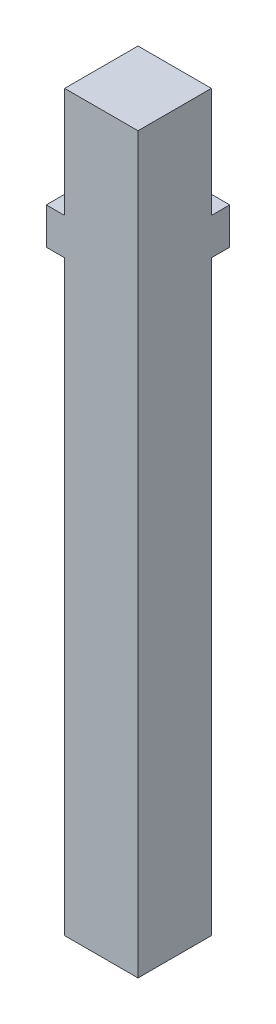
from build123d import *

# Parameters (mm, degrees)
SKETCH1_W           = 25.4
SKETCH1_H           = 25.4
BOSS_EXTRUDE1_DEPTH = 254
BOSS_EXTRUDE2_START = -50.8
SKETCH2_W           = 31.75
SKETCH2_H           = 31.75
BOSS_EXTRUDE2_DEPTH = 12.7


with BuildPart() as part:
    # Sketch1 → Boss-Extrude1 (new body)
    with BuildSketch(Plane(origin=(0, 0, 0), x_dir=(1, 0, 0), z_dir=(0, 1, 0))):
        with Locations((12.7, 12.7)):
            Rectangle(SKETCH1_W, SKETCH1_H)
    extrude(amount=BOSS_EXTRUDE1_DEPTH)

    # Sketch2 → Boss-Extrude2 (add)
    with BuildSketch(Plane(origin=(0, 254, 0), x_dir=(1, 0, 0), z_dir=(0, 1, 0)).offset(BOSS_EXTRUDE2_START)):
        with Locations((9.525, 15.875)):
            Rectangle(SKETCH2_W, SKETCH2_H)
    extrude(amount=BOSS_EXTRUDE2_DEPTH)


solid = part.part
